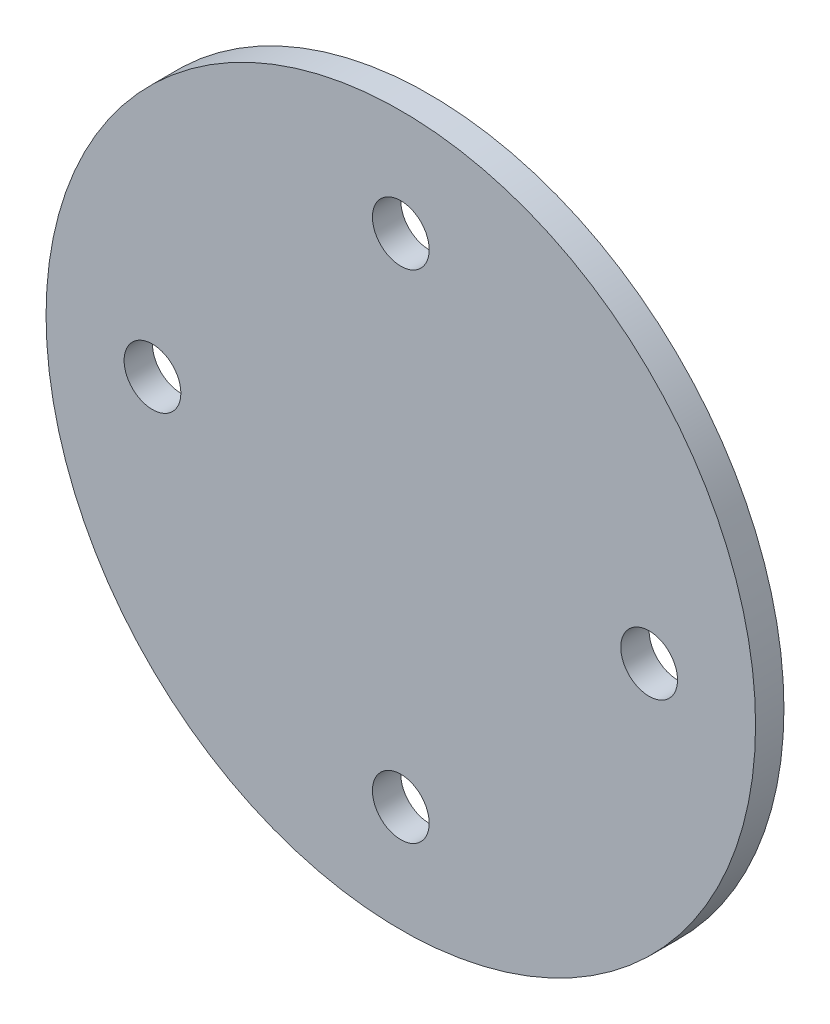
from build123d import *

# Parameters (mm, degrees)
SKETCH1_R      = 50
SKETCH1_R_2    = 4
EXTRUDE1_DEPTH = 4


with BuildPart() as part:
    # Sketch1 → Extrude1 (new body)
    with BuildSketch(Plane.XY):
        Circle(SKETCH1_R)
        with Locations((0, 35)):
            Circle(SKETCH1_R_2, mode=Mode.SUBTRACT)
        with Locations((35, 0)):
            Circle(SKETCH1_R_2, mode=Mode.SUBTRACT)
        with Locations((0, -35)):
            Circle(SKETCH1_R_2, mode=Mode.SUBTRACT)
        with Locations((-35, 0)):
            Circle(SKETCH1_R_2, mode=Mode.SUBTRACT)
    extrude(amount=EXTRUDE1_DEPTH)


solid = part.part
